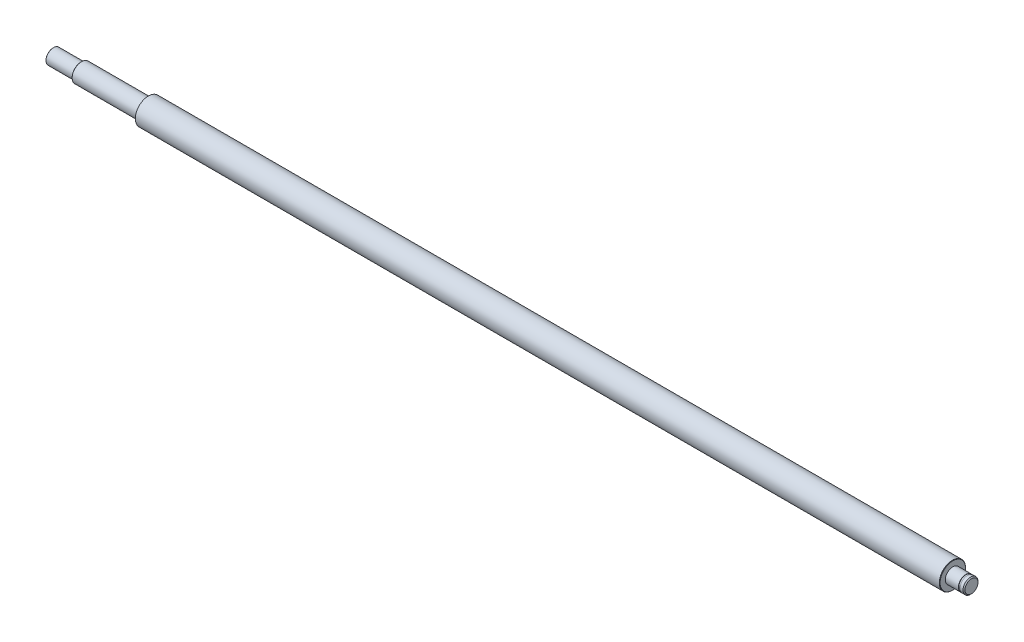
ISO-10303-21;
HEADER;
FILE_DESCRIPTION(('STEP AP214'),'2;1');
FILE_NAME('part.step','',(''),(''),'','','');
FILE_SCHEMA(('AUTOMOTIVE_DESIGN { 1 0 10303 214 1 1 1 1 }'));
ENDSEC;
DATA;
#1=APPLICATION_CONTEXT('core data for automotive mechanical design processes');
#2=APPLICATION_PROTOCOL_DEFINITION('international standard','automotive_design',2000,#1);
#3=PRODUCT_CONTEXT('',#1,'mechanical');
#4=PRODUCT('Part','Part','',(#3));
#5=PRODUCT_RELATED_PRODUCT_CATEGORY('part','',(#4));
#6=PRODUCT_DEFINITION_FORMATION('','',#4);
#7=PRODUCT_DEFINITION_CONTEXT('part definition',#1,'design');
#8=PRODUCT_DEFINITION('design','',#6,#7);
#9=PRODUCT_DEFINITION_SHAPE('','',#8);
#10=(LENGTH_UNIT() NAMED_UNIT(*) SI_UNIT(.MILLI.,.METRE.));
#11=(NAMED_UNIT(*) PLANE_ANGLE_UNIT() SI_UNIT($,.RADIAN.));
#12=(NAMED_UNIT(*) SI_UNIT($,.STERADIAN.) SOLID_ANGLE_UNIT());
#13=UNCERTAINTY_MEASURE_WITH_UNIT(LENGTH_MEASURE(1.E-05),#10,'distance_accuracy_value','');
#14=(GEOMETRIC_REPRESENTATION_CONTEXT(3) GLOBAL_UNCERTAINTY_ASSIGNED_CONTEXT((#13)) GLOBAL_UNIT_ASSIGNED_CONTEXT((#10,
#11,#12)) REPRESENTATION_CONTEXT('',''));
#15=CARTESIAN_POINT('',(0.,0.,0.));
#16=DIRECTION('',(0.,0.,1.));
#17=DIRECTION('',(1.,0.,0.));
#18=AXIS2_PLACEMENT_3D('',#15,#16,#17);
#19=CARTESIAN_POINT('',(-39.8510799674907,0.,0.));
#20=DIRECTION('',(-1.,0.,0.));
#21=DIRECTION('',(0.,0.,1.));
#22=AXIS2_PLACEMENT_3D('',#19,#20,#21);
#23=CYLINDRICAL_SURFACE('',#22,4.);
#24=CARTESIAN_POINT('',(481.5,0.,0.));
#25=DIRECTION('',(-1.,0.,0.));
#26=DIRECTION('',(0.,0.,1.));
#27=AXIS2_PLACEMENT_3D('',#24,#25,#26);
#28=CIRCLE('',#27,4.);
#29=CARTESIAN_POINT('',(481.5,0.,4.));
#30=VERTEX_POINT('',#29);
#31=EDGE_CURVE('E104',#30,#30,#28,.T.);
#32=ORIENTED_EDGE('',*,*,#31,.F.);
#33=EDGE_LOOP('',(#32));
#34=FACE_BOUND('',#33,.T.);
#35=CARTESIAN_POINT('',(488.5,0.,0.));
#36=DIRECTION('',(-1.,0.,0.));
#37=DIRECTION('',(0.,0.,1.));
#38=AXIS2_PLACEMENT_3D('',#35,#36,#37);
#39=CIRCLE('',#38,4.);
#40=CARTESIAN_POINT('',(488.5,0.,4.));
#41=VERTEX_POINT('',#40);
#42=EDGE_CURVE('E77',#41,#41,#39,.T.);
#43=ORIENTED_EDGE('',*,*,#42,.T.);
#44=EDGE_LOOP('',(#43));
#45=FACE_BOUND('',#44,.T.);
#46=ADVANCED_FACE('F51',(#34,#45),#23,.T.);
#47=CARTESIAN_POINT('',(488.5,4.,0.));
#48=DIRECTION('',(-1.,0.,0.));
#49=DIRECTION('',(0.,0.,1.));
#50=AXIS2_PLACEMENT_3D('',#47,#48,#49);
#51=PLANE('',#50);
#52=ORIENTED_EDGE('',*,*,#42,.F.);
#53=EDGE_LOOP('',(#52));
#54=FACE_BOUND('',#53,.T.);
#55=CARTESIAN_POINT('',(488.5,0.,0.));
#56=DIRECTION('',(-1.,0.,0.));
#57=DIRECTION('',(0.,0.,1.));
#58=AXIS2_PLACEMENT_3D('',#55,#56,#57);
#59=CIRCLE('',#58,3.8);
#60=CARTESIAN_POINT('',(488.5,0.,3.8));
#61=VERTEX_POINT('',#60);
#62=EDGE_CURVE('E80',#61,#61,#59,.T.);
#63=ORIENTED_EDGE('',*,*,#62,.T.);
#64=EDGE_LOOP('',(#63));
#65=FACE_BOUND('',#64,.T.);
#66=ADVANCED_FACE('F112',(#54,#65),#51,.F.);
#67=CARTESIAN_POINT('',(-39.8510799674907,0.,0.));
#68=DIRECTION('',(-1.,0.,0.));
#69=DIRECTION('',(0.,0.,1.));
#70=AXIS2_PLACEMENT_3D('',#67,#68,#69);
#71=CYLINDRICAL_SURFACE('',#70,3.8);
#72=ORIENTED_EDGE('',*,*,#62,.F.);
#73=EDGE_LOOP('',(#72));
#74=FACE_BOUND('',#73,.T.);
#75=CARTESIAN_POINT('',(489.4,0.,0.));
#76=DIRECTION('',(-1.,0.,0.));
#77=DIRECTION('',(0.,0.,1.));
#78=AXIS2_PLACEMENT_3D('',#75,#76,#77);
#79=CIRCLE('',#78,3.8);
#80=CARTESIAN_POINT('',(489.4,0.,3.8));
#81=VERTEX_POINT('',#80);
#82=EDGE_CURVE('E83',#81,#81,#79,.T.);
#83=ORIENTED_EDGE('',*,*,#82,.T.);
#84=EDGE_LOOP('',(#83));
#85=FACE_BOUND('',#84,.T.);
#86=ADVANCED_FACE('F118',(#74,#85),#71,.T.);
#87=CARTESIAN_POINT('',(489.4,3.8,0.));
#88=DIRECTION('',(1.,0.,0.));
#89=DIRECTION('',(0.,0.,-1.));
#90=AXIS2_PLACEMENT_3D('',#87,#88,#89);
#91=PLANE('',#90);
#92=ORIENTED_EDGE('',*,*,#82,.F.);
#93=EDGE_LOOP('',(#92));
#94=FACE_BOUND('',#93,.T.);
#95=CARTESIAN_POINT('',(489.4,0.,0.));
#96=DIRECTION('',(-1.,0.,0.));
#97=DIRECTION('',(0.,0.,1.));
#98=AXIS2_PLACEMENT_3D('',#95,#96,#97);
#99=CIRCLE('',#98,4.);
#100=CARTESIAN_POINT('',(489.4,0.,4.));
#101=VERTEX_POINT('',#100);
#102=EDGE_CURVE('E86',#101,#101,#99,.T.);
#103=ORIENTED_EDGE('',*,*,#102,.T.);
#104=EDGE_LOOP('',(#103));
#105=FACE_BOUND('',#104,.T.);
#106=ADVANCED_FACE('F124',(#94,#105),#91,.F.);
#107=CARTESIAN_POINT('',(-39.8510799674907,0.,0.));
#108=DIRECTION('',(-1.,0.,0.));
#109=DIRECTION('',(0.,0.,1.));
#110=AXIS2_PLACEMENT_3D('',#107,#108,#109);
#111=CYLINDRICAL_SURFACE('',#110,4.);
#112=ORIENTED_EDGE('',*,*,#102,.F.);
#113=EDGE_LOOP('',(#112));
#114=FACE_BOUND('',#113,.T.);
#115=CARTESIAN_POINT('',(491.,0.,0.));
#116=DIRECTION('',(-1.,0.,0.));
#117=DIRECTION('',(0.,0.,1.));
#118=AXIS2_PLACEMENT_3D('',#115,#116,#117);
#119=CIRCLE('',#118,4.);
#120=CARTESIAN_POINT('',(491.,0.,4.));
#121=VERTEX_POINT('',#120);
#122=EDGE_CURVE('E89',#121,#121,#119,.T.);
#123=ORIENTED_EDGE('',*,*,#122,.T.);
#124=EDGE_LOOP('',(#123));
#125=FACE_BOUND('',#124,.T.);
#126=ADVANCED_FACE('F130',(#114,#125),#111,.T.);
#127=CARTESIAN_POINT('',(491.5,0.,0.));
#128=DIRECTION('',(-1.,0.,0.));
#129=DIRECTION('',(0.,0.,1.));
#130=AXIS2_PLACEMENT_3D('',#127,#128,#129);
#131=CONICAL_SURFACE('',#130,3.50000000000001,0.785398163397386);
#132=ORIENTED_EDGE('',*,*,#122,.F.);
#133=EDGE_LOOP('',(#132));
#134=FACE_BOUND('',#133,.T.);
#135=CARTESIAN_POINT('',(491.5,0.,0.));
#136=DIRECTION('',(-1.,0.,0.));
#137=DIRECTION('',(0.,0.,1.));
#138=AXIS2_PLACEMENT_3D('',#135,#136,#137);
#139=CIRCLE('',#138,3.50000000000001);
#140=CARTESIAN_POINT('',(491.5,0.,3.50000000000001));
#141=VERTEX_POINT('',#140);
#142=EDGE_CURVE('E92',#141,#141,#139,.T.);
#143=ORIENTED_EDGE('',*,*,#142,.T.);
#144=EDGE_LOOP('',(#143));
#145=FACE_BOUND('',#144,.T.);
#146=ADVANCED_FACE('F136',(#134,#145),#131,.T.);
#147=CARTESIAN_POINT('',(491.5,3.50000000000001,0.));
#148=DIRECTION('',(-1.,0.,0.));
#149=DIRECTION('',(0.,0.,1.));
#150=AXIS2_PLACEMENT_3D('',#147,#148,#149);
#151=PLANE('',#150);
#152=ORIENTED_EDGE('',*,*,#142,.F.);
#153=EDGE_LOOP('',(#152));
#154=FACE_BOUND('',#153,.T.);
#155=ADVANCED_FACE('F142',(#154),#151,.F.);
#156=CARTESIAN_POINT('',(0.,4.,0.));
#157=DIRECTION('',(1.,0.,0.));
#158=DIRECTION('',(0.,0.,-1.));
#159=AXIS2_PLACEMENT_3D('',#156,#157,#158);
#160=PLANE('',#159);
#161=CARTESIAN_POINT('',(0.,0.,0.));
#162=DIRECTION('',(1.,0.,0.));
#163=DIRECTION('',(0.,0.,-1.));
#164=AXIS2_PLACEMENT_3D('',#161,#162,#163);
#165=CIRCLE('',#164,3.80000000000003);
#166=CARTESIAN_POINT('',(0.,0.,-3.80000000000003));
#167=VERTEX_POINT('',#166);
#168=EDGE_CURVE('E58',#167,#167,#165,.F.);
#169=ORIENTED_EDGE('',*,*,#168,.T.);
#170=EDGE_LOOP('',(#169));
#171=FACE_BOUND('',#170,.T.);
#172=ADVANCED_FACE('F147',(#171),#160,.F.);
#173=CARTESIAN_POINT('',(-39.8510799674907,0.,0.));
#174=DIRECTION('',(-1.,0.,0.));
#175=DIRECTION('',(0.,0.,1.));
#176=AXIS2_PLACEMENT_3D('',#173,#174,#175);
#177=CYLINDRICAL_SURFACE('',#176,4.);
#178=CARTESIAN_POINT('',(0.199999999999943,0.,0.));
#179=DIRECTION('',(1.,0.,0.));
#180=DIRECTION('',(0.,0.,-1.));
#181=AXIS2_PLACEMENT_3D('',#178,#179,#180);
#182=CIRCLE('',#181,4.);
#183=CARTESIAN_POINT('',(0.199999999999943,0.,-4.));
#184=VERTEX_POINT('',#183);
#185=EDGE_CURVE('E12',#184,#184,#182,.T.);
#186=ORIENTED_EDGE('',*,*,#185,.T.);
#187=EDGE_LOOP('',(#186));
#188=FACE_BOUND('',#187,.T.);
#189=CARTESIAN_POINT('',(15.,0.,0.));
#190=DIRECTION('',(-1.,0.,0.));
#191=DIRECTION('',(0.,0.,1.));
#192=AXIS2_PLACEMENT_3D('',#189,#190,#191);
#193=CIRCLE('',#192,4.);
#194=CARTESIAN_POINT('',(15.,0.,4.));
#195=VERTEX_POINT('',#194);
#196=EDGE_CURVE('E95',#195,#195,#193,.T.);
#197=ORIENTED_EDGE('',*,*,#196,.T.);
#198=EDGE_LOOP('',(#197));
#199=FACE_BOUND('',#198,.T.);
#200=ADVANCED_FACE('F152',(#188,#199),#177,.T.);
#201=CARTESIAN_POINT('',(15.,4.,0.));
#202=DIRECTION('',(1.,0.,0.));
#203=DIRECTION('',(0.,0.,-1.));
#204=AXIS2_PLACEMENT_3D('',#201,#202,#203);
#205=PLANE('',#204);
#206=CARTESIAN_POINT('',(15.,0.,0.));
#207=DIRECTION('',(1.,0.,0.));
#208=DIRECTION('',(0.,0.,-1.));
#209=AXIS2_PLACEMENT_3D('',#206,#207,#208);
#210=CIRCLE('',#209,4.80000000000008);
#211=CARTESIAN_POINT('',(15.,0.,-4.80000000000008));
#212=VERTEX_POINT('',#211);
#213=EDGE_CURVE('E66',#212,#212,#210,.F.);
#214=ORIENTED_EDGE('',*,*,#213,.T.);
#215=EDGE_LOOP('',(#214));
#216=FACE_BOUND('',#215,.T.);
#217=ORIENTED_EDGE('',*,*,#196,.F.);
#218=EDGE_LOOP('',(#217));
#219=FACE_BOUND('',#218,.T.);
#220=ADVANCED_FACE('F170',(#216,#219),#205,.F.);
#221=CARTESIAN_POINT('',(-39.8510799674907,0.,0.));
#222=DIRECTION('',(-1.,0.,0.));
#223=DIRECTION('',(0.,0.,1.));
#224=AXIS2_PLACEMENT_3D('',#221,#222,#223);
#225=CYLINDRICAL_SURFACE('',#224,5.);
#226=CARTESIAN_POINT('',(15.1999999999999,0.,0.));
#227=DIRECTION('',(1.,0.,0.));
#228=DIRECTION('',(0.,0.,-1.));
#229=AXIS2_PLACEMENT_3D('',#226,#227,#228);
#230=CIRCLE('',#229,5.);
#231=CARTESIAN_POINT('',(15.1999999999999,0.,-5.));
#232=VERTEX_POINT('',#231);
#233=EDGE_CURVE('E62',#232,#232,#230,.T.);
#234=ORIENTED_EDGE('',*,*,#233,.T.);
#235=EDGE_LOOP('',(#234));
#236=FACE_BOUND('',#235,.T.);
#237=CARTESIAN_POINT('',(51.,0.,0.));
#238=DIRECTION('',(-1.,0.,0.));
#239=DIRECTION('',(0.,0.,1.));
#240=AXIS2_PLACEMENT_3D('',#237,#238,#239);
#241=CIRCLE('',#240,5.);
#242=CARTESIAN_POINT('',(51.,0.,5.));
#243=VERTEX_POINT('',#242);
#244=EDGE_CURVE('E98',#243,#243,#241,.T.);
#245=ORIENTED_EDGE('',*,*,#244,.T.);
#246=EDGE_LOOP('',(#245));
#247=FACE_BOUND('',#246,.T.);
#248=ADVANCED_FACE('F173',(#236,#247),#225,.T.);
#249=CARTESIAN_POINT('',(51.,5.,0.));
#250=DIRECTION('',(1.,0.,0.));
#251=DIRECTION('',(0.,0.,-1.));
#252=AXIS2_PLACEMENT_3D('',#249,#250,#251);
#253=PLANE('',#252);
#254=ORIENTED_EDGE('',*,*,#244,.F.);
#255=EDGE_LOOP('',(#254));
#256=FACE_BOUND('',#255,.T.);
#257=CARTESIAN_POINT('',(51.,0.,0.));
#258=DIRECTION('',(-1.,0.,0.));
#259=DIRECTION('',(0.,0.,1.));
#260=AXIS2_PLACEMENT_3D('',#257,#258,#259);
#261=CIRCLE('',#260,7.);
#262=CARTESIAN_POINT('',(51.,0.,7.));
#263=VERTEX_POINT('',#262);
#264=EDGE_CURVE('E101',#263,#263,#261,.T.);
#265=ORIENTED_EDGE('',*,*,#264,.T.);
#266=EDGE_LOOP('',(#265));
#267=FACE_BOUND('',#266,.T.);
#268=ADVANCED_FACE('F183',(#256,#267),#253,.F.);
#269=CARTESIAN_POINT('',(-39.8510799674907,0.,0.));
#270=DIRECTION('',(-1.,0.,0.));
#271=DIRECTION('',(0.,0.,1.));
#272=AXIS2_PLACEMENT_3D('',#269,#270,#271);
#273=CYLINDRICAL_SURFACE('',#272,7.);
#274=CARTESIAN_POINT('',(481.3,0.,0.));
#275=DIRECTION('',(-1.,0.,0.));
#276=DIRECTION('',(0.,0.,1.));
#277=AXIS2_PLACEMENT_3D('',#274,#275,#276);
#278=CIRCLE('',#277,7.);
#279=CARTESIAN_POINT('',(481.3,0.,7.));
#280=VERTEX_POINT('',#279);
#281=EDGE_CURVE('E74',#280,#280,#278,.T.);
#282=ORIENTED_EDGE('',*,*,#281,.T.);
#283=EDGE_LOOP('',(#282));
#284=FACE_BOUND('',#283,.T.);
#285=ORIENTED_EDGE('',*,*,#264,.F.);
#286=EDGE_LOOP('',(#285));
#287=FACE_BOUND('',#286,.T.);
#288=ADVANCED_FACE('F187',(#284,#287),#273,.T.);
#289=CARTESIAN_POINT('',(481.5,7.,0.));
#290=DIRECTION('',(-1.,0.,0.));
#291=DIRECTION('',(0.,0.,1.));
#292=AXIS2_PLACEMENT_3D('',#289,#290,#291);
#293=PLANE('',#292);
#294=CARTESIAN_POINT('',(481.5,0.,0.));
#295=DIRECTION('',(-1.,0.,0.));
#296=DIRECTION('',(0.,0.,1.));
#297=AXIS2_PLACEMENT_3D('',#294,#295,#296);
#298=CIRCLE('',#297,6.80000000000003);
#299=CARTESIAN_POINT('',(481.5,0.,6.80000000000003));
#300=VERTEX_POINT('',#299);
#301=EDGE_CURVE('E71',#300,#300,#298,.F.);
#302=ORIENTED_EDGE('',*,*,#301,.T.);
#303=EDGE_LOOP('',(#302));
#304=FACE_BOUND('',#303,.T.);
#305=ORIENTED_EDGE('',*,*,#31,.T.);
#306=EDGE_LOOP('',(#305));
#307=FACE_BOUND('',#306,.T.);
#308=ADVANCED_FACE('F108',(#304,#307),#293,.F.);
#309=CARTESIAN_POINT('',(481.3,0.,0.));
#310=DIRECTION('',(-1.,0.,0.));
#311=DIRECTION('',(0.,0.,1.));
#312=AXIS2_PLACEMENT_3D('',#309,#310,#311);
#313=CONICAL_SURFACE('',#312,7.,0.785398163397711);
#314=ORIENTED_EDGE('',*,*,#301,.F.);
#315=EDGE_LOOP('',(#314));
#316=FACE_BOUND('',#315,.T.);
#317=ORIENTED_EDGE('',*,*,#281,.F.);
#318=EDGE_LOOP('',(#317));
#319=FACE_BOUND('',#318,.T.);
#320=ADVANCED_FACE('F156',(#316,#319),#313,.T.);
#321=CARTESIAN_POINT('',(15.,0.,0.));
#322=DIRECTION('',(1.,0.,0.));
#323=DIRECTION('',(0.,0.,-1.));
#324=AXIS2_PLACEMENT_3D('',#321,#322,#323);
#325=CONICAL_SURFACE('',#324,4.80000000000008,0.785398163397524);
#326=ORIENTED_EDGE('',*,*,#233,.F.);
#327=EDGE_LOOP('',(#326));
#328=FACE_BOUND('',#327,.T.);
#329=ORIENTED_EDGE('',*,*,#213,.F.);
#330=EDGE_LOOP('',(#329));
#331=FACE_BOUND('',#330,.T.);
#332=ADVANCED_FACE('F158',(#328,#331),#325,.T.);
#333=CARTESIAN_POINT('',(0.,0.,0.));
#334=DIRECTION('',(1.,0.,0.));
#335=DIRECTION('',(0.,0.,-1.));
#336=AXIS2_PLACEMENT_3D('',#333,#334,#335);
#337=CONICAL_SURFACE('',#336,3.80000000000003,0.785398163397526);
#338=ORIENTED_EDGE('',*,*,#185,.F.);
#339=EDGE_LOOP('',(#338));
#340=FACE_BOUND('',#339,.T.);
#341=ORIENTED_EDGE('',*,*,#168,.F.);
#342=EDGE_LOOP('',(#341));
#343=FACE_BOUND('',#342,.T.);
#344=ADVANCED_FACE('F53',(#340,#343),#337,.T.);
#345=CLOSED_SHELL('',(#46,#66,#86,#106,#126,#146,#155,#172,#200,#220,#248,#268,#288,#308,#320,
#332,#344));
#346=MANIFOLD_SOLID_BREP('B2',#345);
#347=ADVANCED_BREP_SHAPE_REPRESENTATION('',(#18,#346),#14);
#348=SHAPE_DEFINITION_REPRESENTATION(#9,#347);
ENDSEC;
END-ISO-10303-21;
